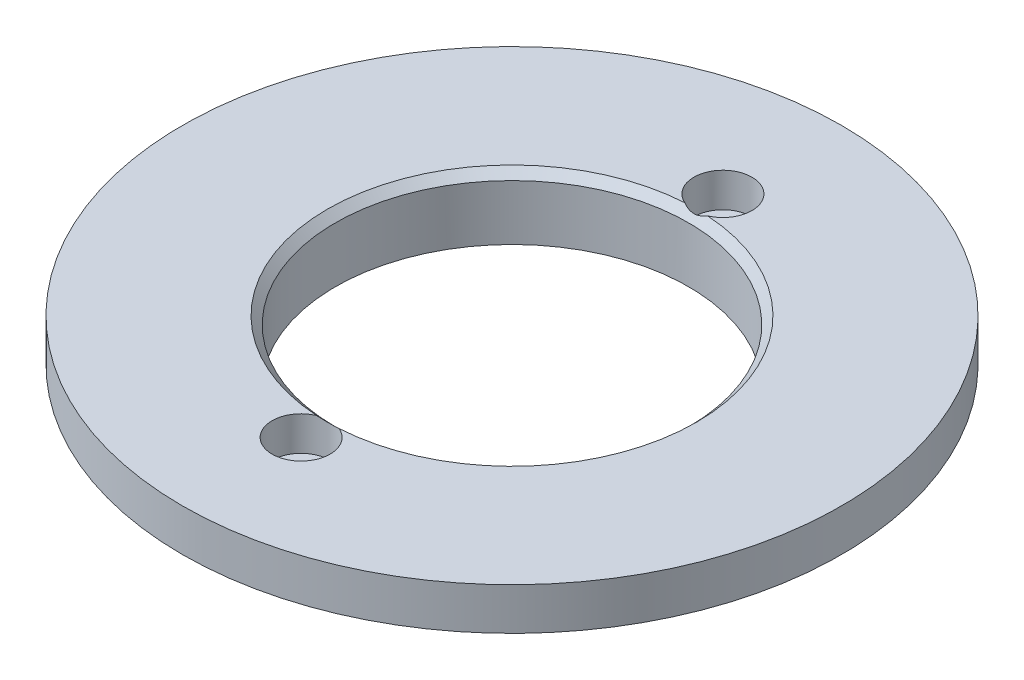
ISO-10303-21;
HEADER;
FILE_DESCRIPTION(('STEP AP214'),'2;1');
FILE_NAME('part.step','',(''),(''),'','','');
FILE_SCHEMA(('AUTOMOTIVE_DESIGN { 1 0 10303 214 1 1 1 1 }'));
ENDSEC;
DATA;
#1=APPLICATION_CONTEXT('core data for automotive mechanical design processes');
#2=APPLICATION_PROTOCOL_DEFINITION('international standard','automotive_design',2000,#1);
#3=PRODUCT_CONTEXT('',#1,'mechanical');
#4=PRODUCT('Part','Part','',(#3));
#5=PRODUCT_RELATED_PRODUCT_CATEGORY('part','',(#4));
#6=PRODUCT_DEFINITION_FORMATION('','',#4);
#7=PRODUCT_DEFINITION_CONTEXT('part definition',#1,'design');
#8=PRODUCT_DEFINITION('design','',#6,#7);
#9=PRODUCT_DEFINITION_SHAPE('','',#8);
#10=(LENGTH_UNIT() NAMED_UNIT(*) SI_UNIT(.MILLI.,.METRE.));
#11=(NAMED_UNIT(*) PLANE_ANGLE_UNIT() SI_UNIT($,.RADIAN.));
#12=(NAMED_UNIT(*) SI_UNIT($,.STERADIAN.) SOLID_ANGLE_UNIT());
#13=UNCERTAINTY_MEASURE_WITH_UNIT(LENGTH_MEASURE(1.E-05),#10,'distance_accuracy_value','');
#14=(GEOMETRIC_REPRESENTATION_CONTEXT(3) GLOBAL_UNCERTAINTY_ASSIGNED_CONTEXT((#13)) GLOBAL_UNIT_ASSIGNED_CONTEXT((#10,
#11,#12)) REPRESENTATION_CONTEXT('',''));
#15=CARTESIAN_POINT('',(0.,0.,0.));
#16=DIRECTION('',(0.,0.,1.));
#17=DIRECTION('',(1.,0.,0.));
#18=AXIS2_PLACEMENT_3D('',#15,#16,#17);
#19=CARTESIAN_POINT('',(0.,93.,65.));
#20=DIRECTION('',(0.,-1.,0.));
#21=DIRECTION('',(0.,0.,-1.));
#22=AXIS2_PLACEMENT_3D('',#19,#20,#21);
#23=CYLINDRICAL_SURFACE('',#22,45.);
#24=CARTESIAN_POINT('',(0.,89.,65.));
#25=DIRECTION('',(0.,-1.,0.));
#26=DIRECTION('',(0.,0.,-1.));
#27=AXIS2_PLACEMENT_3D('',#24,#25,#26);
#28=CIRCLE('',#27,45.);
#29=CARTESIAN_POINT('',(0.,89.,20.));
#30=VERTEX_POINT('',#29);
#31=EDGE_CURVE('E153',#30,#30,#28,.T.);
#32=ORIENTED_EDGE('',*,*,#31,.F.);
#33=EDGE_LOOP('',(#32));
#34=FACE_BOUND('',#33,.T.);
#35=CARTESIAN_POINT('',(0.,93.,65.));
#36=DIRECTION('',(0.,-1.,0.));
#37=DIRECTION('',(0.,0.,-1.));
#38=AXIS2_PLACEMENT_3D('',#35,#36,#37);
#39=CIRCLE('',#38,45.);
#40=CARTESIAN_POINT('',(0.,93.,20.));
#41=VERTEX_POINT('',#40);
#42=EDGE_CURVE('E20',#41,#41,#39,.F.);
#43=ORIENTED_EDGE('',*,*,#42,.F.);
#44=EDGE_LOOP('',(#43));
#45=FACE_BOUND('',#44,.T.);
#46=ADVANCED_FACE('F16',(#34,#45),#23,.T.);
#47=CARTESIAN_POINT('',(0.,89.,25.));
#48=DIRECTION('',(0.,1.,0.));
#49=DIRECTION('',(0.,0.,1.));
#50=AXIS2_PLACEMENT_3D('',#47,#48,#49);
#51=CYLINDRICAL_SURFACE('',#50,3.5);
#52=CARTESIAN_POINT('',(0.,89.,25.));
#53=DIRECTION('',(0.,1.,0.));
#54=DIRECTION('',(0.,0.,1.));
#55=AXIS2_PLACEMENT_3D('',#52,#53,#54);
#56=CIRCLE('',#55,3.5);
#57=CARTESIAN_POINT('',(0.,89.,28.5));
#58=VERTEX_POINT('',#57);
#59=EDGE_CURVE('E147',#58,#58,#56,.T.);
#60=ORIENTED_EDGE('',*,*,#59,.F.);
#61=EDGE_LOOP('',(#60));
#62=FACE_BOUND('',#61,.T.);
#63=CARTESIAN_POINT('',(0.,94.5,25.));
#64=DIRECTION('',(0.,1.,0.));
#65=DIRECTION('',(0.,0.,1.));
#66=AXIS2_PLACEMENT_3D('',#63,#64,#65);
#67=CIRCLE('',#66,3.5);
#68=CARTESIAN_POINT('',(0.,94.5,28.5));
#69=VERTEX_POINT('',#68);
#70=EDGE_CURVE('E155',#69,#69,#67,.T.);
#71=ORIENTED_EDGE('',*,*,#70,.T.);
#72=EDGE_LOOP('',(#71));
#73=FACE_BOUND('',#72,.T.);
#74=ADVANCED_FACE('F85',(#62,#73),#51,.F.);
#75=CARTESIAN_POINT('',(0.,89.,105.));
#76=DIRECTION('',(0.,1.,0.));
#77=DIRECTION('',(0.,0.,1.));
#78=AXIS2_PLACEMENT_3D('',#75,#76,#77);
#79=CYLINDRICAL_SURFACE('',#78,3.5);
#80=CARTESIAN_POINT('',(0.,89.,105.));
#81=DIRECTION('',(0.,1.,0.));
#82=DIRECTION('',(0.,0.,1.));
#83=AXIS2_PLACEMENT_3D('',#80,#81,#82);
#84=CIRCLE('',#83,3.5);
#85=CARTESIAN_POINT('',(0.,89.,108.5));
#86=VERTEX_POINT('',#85);
#87=EDGE_CURVE('E150',#86,#86,#84,.T.);
#88=ORIENTED_EDGE('',*,*,#87,.F.);
#89=EDGE_LOOP('',(#88));
#90=FACE_BOUND('',#89,.T.);
#91=CARTESIAN_POINT('',(0.,94.5,105.));
#92=DIRECTION('',(0.,1.,0.));
#93=DIRECTION('',(0.,0.,1.));
#94=AXIS2_PLACEMENT_3D('',#91,#92,#93);
#95=CIRCLE('',#94,3.5);
#96=CARTESIAN_POINT('',(0.,94.5,108.5));
#97=VERTEX_POINT('',#96);
#98=EDGE_CURVE('E144',#97,#97,#95,.T.);
#99=ORIENTED_EDGE('',*,*,#98,.T.);
#100=EDGE_LOOP('',(#99));
#101=FACE_BOUND('',#100,.T.);
#102=ADVANCED_FACE('F81',(#90,#101),#79,.F.);
#103=CARTESIAN_POINT('',(-63.25,93.,1.75));
#104=DIRECTION('',(0.,-1.,0.));
#105=DIRECTION('',(1.,0.,0.));
#106=AXIS2_PLACEMENT_3D('',#103,#104,#105);
#107=PLANE('',#106);
#108=ORIENTED_EDGE('',*,*,#42,.T.);
#109=EDGE_LOOP('',(#108));
#110=FACE_BOUND('',#109,.T.);
#111=CARTESIAN_POINT('',(0.,93.,65.));
#112=DIRECTION('',(0.,1.,0.));
#113=DIRECTION('',(0.,0.,1.));
#114=AXIS2_PLACEMENT_3D('',#111,#112,#113);
#115=CIRCLE('',#114,62.5);
#116=CARTESIAN_POINT('',(0.,93.,127.5));
#117=VERTEX_POINT('',#116);
#118=EDGE_CURVE('E141',#117,#117,#115,.F.);
#119=ORIENTED_EDGE('',*,*,#118,.T.);
#120=EDGE_LOOP('',(#119));
#121=FACE_BOUND('',#120,.T.);
#122=ADVANCED_FACE('F84',(#110,#121),#107,.T.);
#123=CARTESIAN_POINT('',(5.566,94.5,30.566));
#124=DIRECTION('',(0.,-1.,0.));
#125=DIRECTION('',(-1.,0.,0.));
#126=AXIS2_PLACEMENT_3D('',#123,#124,#125);
#127=PLANE('',#126);
#128=ORIENTED_EDGE('',*,*,#70,.F.);
#129=EDGE_LOOP('',(#128));
#130=FACE_BOUND('',#129,.T.);
#131=CARTESIAN_POINT('',(0.,94.5,25.));
#132=DIRECTION('',(0.,1.,0.));
#133=DIRECTION('',(0.,0.,1.));
#134=AXIS2_PLACEMENT_3D('',#131,#132,#133);
#135=CIRCLE('',#134,5.5);
#136=CARTESIAN_POINT('',(0.,94.5,30.5));
#137=VERTEX_POINT('',#136);
#138=EDGE_CURVE('E136',#137,#137,#135,.F.);
#139=ORIENTED_EDGE('',*,*,#138,.F.);
#140=EDGE_LOOP('',(#139));
#141=FACE_BOUND('',#140,.T.);
#142=ADVANCED_FACE('F95',(#130,#141),#127,.F.);
#143=CARTESIAN_POINT('',(45.54,89.,110.54));
#144=DIRECTION('',(0.,-1.,0.));
#145=DIRECTION('',(-1.,0.,0.));
#146=AXIS2_PLACEMENT_3D('',#143,#144,#145);
#147=PLANE('',#146);
#148=CARTESIAN_POINT('',(0.,89.,65.));
#149=DIRECTION('',(0.,1.,0.));
#150=DIRECTION('',(0.,0.,1.));
#151=AXIS2_PLACEMENT_3D('',#148,#149,#150);
#152=CIRCLE('',#151,33.5);
#153=CARTESIAN_POINT('',(0.,89.,98.5));
#154=VERTEX_POINT('',#153);
#155=EDGE_CURVE('E131',#154,#154,#152,.F.);
#156=ORIENTED_EDGE('',*,*,#155,.F.);
#157=EDGE_LOOP('',(#156));
#158=FACE_BOUND('',#157,.T.);
#159=ORIENTED_EDGE('',*,*,#59,.T.);
#160=EDGE_LOOP('',(#159));
#161=FACE_BOUND('',#160,.T.);
#162=ORIENTED_EDGE('',*,*,#87,.T.);
#163=EDGE_LOOP('',(#162));
#164=FACE_BOUND('',#163,.T.);
#165=ORIENTED_EDGE('',*,*,#31,.T.);
#166=EDGE_LOOP('',(#165));
#167=FACE_BOUND('',#166,.T.);
#168=ADVANCED_FACE('F99',(#158,#161,#164,#167),#147,.T.);
#169=CARTESIAN_POINT('',(5.566,94.5,110.566));
#170=DIRECTION('',(0.,-1.,0.));
#171=DIRECTION('',(-1.,0.,0.));
#172=AXIS2_PLACEMENT_3D('',#169,#170,#171);
#173=PLANE('',#172);
#174=ORIENTED_EDGE('',*,*,#98,.F.);
#175=EDGE_LOOP('',(#174));
#176=FACE_BOUND('',#175,.T.);
#177=CARTESIAN_POINT('',(0.,94.5,105.));
#178=DIRECTION('',(0.,1.,0.));
#179=DIRECTION('',(0.,0.,1.));
#180=AXIS2_PLACEMENT_3D('',#177,#178,#179);
#181=CIRCLE('',#180,5.5);
#182=CARTESIAN_POINT('',(0.,94.5,110.5));
#183=VERTEX_POINT('',#182);
#184=EDGE_CURVE('E129',#183,#183,#181,.F.);
#185=ORIENTED_EDGE('',*,*,#184,.F.);
#186=EDGE_LOOP('',(#185));
#187=FACE_BOUND('',#186,.T.);
#188=ADVANCED_FACE('F79',(#176,#187),#173,.F.);
#189=CARTESIAN_POINT('',(0.,93.,65.));
#190=DIRECTION('',(0.,1.,0.));
#191=DIRECTION('',(0.,0.,1.));
#192=AXIS2_PLACEMENT_3D('',#189,#190,#191);
#193=CYLINDRICAL_SURFACE('',#192,62.5);
#194=CARTESIAN_POINT('',(0.,101.,65.));
#195=DIRECTION('',(0.,1.,0.));
#196=DIRECTION('',(0.,0.,1.));
#197=AXIS2_PLACEMENT_3D('',#194,#195,#196);
#198=CIRCLE('',#197,62.5);
#199=CARTESIAN_POINT('',(0.,101.,127.5));
#200=VERTEX_POINT('',#199);
#201=EDGE_CURVE('E130',#200,#200,#198,.T.);
#202=ORIENTED_EDGE('',*,*,#201,.F.);
#203=EDGE_LOOP('',(#202));
#204=FACE_BOUND('',#203,.T.);
#205=ORIENTED_EDGE('',*,*,#118,.F.);
#206=EDGE_LOOP('',(#205));
#207=FACE_BOUND('',#206,.T.);
#208=ADVANCED_FACE('F76',(#204,#207),#193,.T.);
#209=CARTESIAN_POINT('',(0.,94.5,25.));
#210=DIRECTION('',(0.,1.,0.));
#211=DIRECTION('',(0.,0.,1.));
#212=AXIS2_PLACEMENT_3D('',#209,#210,#211);
#213=CYLINDRICAL_SURFACE('',#212,5.5);
#214=CARTESIAN_POINT('',(0.,101.,25.));
#215=DIRECTION('',(0.,1.,0.));
#216=DIRECTION('',(0.,0.,1.));
#217=AXIS2_PLACEMENT_3D('',#214,#215,#216);
#218=CIRCLE('',#217,5.5);
#219=CARTESIAN_POINT('',(-2.14229861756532,101.00000000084,30.0656249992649));
#220=VERTEX_POINT('',#219);
#221=CARTESIAN_POINT('',(2.14229861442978,101.,30.065625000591));
#222=VERTEX_POINT('',#221);
#223=EDGE_CURVE('E50',#220,#222,#218,.F.);
#224=ORIENTED_EDGE('',*,*,#223,.F.);
#225=CARTESIAN_POINT('',(2.1422986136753,100.99999999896,30.06562500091));
#226=CARTESIAN_POINT('',(2.0503284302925,100.955540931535,30.1045268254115));
#227=CARTESIAN_POINT('',(1.95630588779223,100.913395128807,30.1413300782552));
#228=CARTESIAN_POINT('',(1.76436297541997,100.834266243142,30.2103182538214));
#229=CARTESIAN_POINT('',(1.66643904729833,100.797288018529,30.2424988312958));
#230=CARTESIAN_POINT('',(1.46663689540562,100.728966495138,30.3018757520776));
#231=CARTESIAN_POINT('',(1.36474324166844,100.697648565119,30.3290496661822));
#232=CARTESIAN_POINT('',(1.15791147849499,100.641425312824,30.3777805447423));
#233=CARTESIAN_POINT('',(1.05297426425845,100.616518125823,30.3993391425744));
#234=CARTESIAN_POINT('',(0.840018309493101,100.573489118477,30.4365539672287));
#235=CARTESIAN_POINT('',(0.731985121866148,100.555407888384,30.4521748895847));
#236=CARTESIAN_POINT('',(0.514210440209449,100.526652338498,30.4770060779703));
#237=CARTESIAN_POINT('',(0.404469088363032,100.515977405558,30.4862168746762));
#238=CARTESIAN_POINT('',(0.184461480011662,100.502312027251,30.4980063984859));
#239=CARTESIAN_POINT('',(0.0741975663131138,100.499300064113,30.5006036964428));
#240=CARTESIAN_POINT('',(-0.146218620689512,100.500973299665,30.4991605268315));
#241=CARTESIAN_POINT('',(-0.25637090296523,100.505657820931,30.4951206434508));
#242=CARTESIAN_POINT('',(-0.467911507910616,100.522009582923,30.4810114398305));
#243=CARTESIAN_POINT('',(-0.569369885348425,100.533160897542,30.4713875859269));
#244=CARTESIAN_POINT('',(-0.770729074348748,100.561771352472,30.4466770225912));
#245=CARTESIAN_POINT('',(-0.870629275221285,100.579232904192,30.4315882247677));
#246=CARTESIAN_POINT('',(-1.16732193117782,100.640675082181,30.3784416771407));
#247=CARTESIAN_POINT('',(-1.3609706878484,100.693702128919,30.3325132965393));
#248=CARTESIAN_POINT('',(-1.65147014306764,100.791753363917,30.2473136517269));
#249=CARTESIAN_POINT('',(-1.75275664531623,100.829687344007,30.2143066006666));
#250=CARTESIAN_POINT('',(-1.9508179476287,100.910944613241,30.1434699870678));
#251=CARTESIAN_POINT('',(-2.0476111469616,100.954242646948,30.1056630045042));
#252=CARTESIAN_POINT('',(-2.14229861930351,101.00000000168,30.0656249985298));
#253=B_SPLINE_CURVE_WITH_KNOTS('',3,(#225,#226,#227,#228,#229,#230,#231,#232,#233,#234,#235,
#236,#237,#238,#239,#240,#241,#242,#243,#244,#245,#246,#247,#248,#249,#250,#251,#252),
.UNSPECIFIED.,.F.,.F.,(4,2,2,2,2,2,2,2,2,2,2,2,2,4),(0.,0.327922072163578,0.656150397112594,
0.985815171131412,1.31538394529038,1.64688272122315,1.97835405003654,2.30889356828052,
2.63940399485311,2.9465978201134,3.25390916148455,3.8689367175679,4.20792271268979,
4.54536935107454),.UNSPECIFIED.);
#254=EDGE_CURVE('E49',#222,#220,#253,.T.);
#255=ORIENTED_EDGE('',*,*,#254,.F.);
#256=EDGE_LOOP('',(#224,#255));
#257=FACE_BOUND('',#256,.T.);
#258=ORIENTED_EDGE('',*,*,#138,.T.);
#259=EDGE_LOOP('',(#258));
#260=FACE_BOUND('',#259,.T.);
#261=ADVANCED_FACE('F55',(#257,#260),#213,.F.);
#262=CARTESIAN_POINT('',(0.,89.,65.));
#263=DIRECTION('',(0.,1.,0.));
#264=DIRECTION('',(0.,0.,1.));
#265=AXIS2_PLACEMENT_3D('',#262,#263,#264);
#266=CYLINDRICAL_SURFACE('',#265,33.5);
#267=CARTESIAN_POINT('',(0.,99.5,65.));
#268=DIRECTION('',(0.,1.,0.));
#269=DIRECTION('',(1.,0.,0.));
#270=AXIS2_PLACEMENT_3D('',#267,#268,#269);
#271=CIRCLE('',#270,33.5);
#272=CARTESIAN_POINT('',(33.5,99.5,65.));
#273=VERTEX_POINT('',#272);
#274=EDGE_CURVE('E57',#273,#273,#271,.F.);
#275=ORIENTED_EDGE('',*,*,#274,.F.);
#276=EDGE_LOOP('',(#275));
#277=FACE_BOUND('',#276,.T.);
#278=ORIENTED_EDGE('',*,*,#155,.T.);
#279=EDGE_LOOP('',(#278));
#280=FACE_BOUND('',#279,.T.);
#281=ADVANCED_FACE('F75',(#277,#280),#266,.F.);
#282=CARTESIAN_POINT('',(0.,94.5,105.));
#283=DIRECTION('',(0.,1.,0.));
#284=DIRECTION('',(0.,0.,1.));
#285=AXIS2_PLACEMENT_3D('',#282,#283,#284);
#286=CYLINDRICAL_SURFACE('',#285,5.5);
#287=ORIENTED_EDGE('',*,*,#184,.T.);
#288=EDGE_LOOP('',(#287));
#289=FACE_BOUND('',#288,.T.);
#290=CARTESIAN_POINT('',(-2.14229862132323,101.000000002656,99.9343750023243));
#291=CARTESIAN_POINT('',(-2.0503284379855,100.955540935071,99.8954731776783));
#292=CARTESIAN_POINT('',(-1.95630589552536,100.913395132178,99.858669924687));
#293=CARTESIAN_POINT('',(-1.76436298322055,100.834266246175,99.7896817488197));
#294=CARTESIAN_POINT('',(-1.66643905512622,100.797288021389,99.7575011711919));
#295=CARTESIAN_POINT('',(-1.46663690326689,100.728966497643,99.6981242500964));
#296=CARTESIAN_POINT('',(-1.36474324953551,100.697648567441,99.6709503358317));
#297=CARTESIAN_POINT('',(-1.1579114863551,100.641425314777,99.6222194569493));
#298=CARTESIAN_POINT('',(-1.05297427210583,100.61651812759,99.600660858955));
#299=CARTESIAN_POINT('',(-0.840018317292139,100.57348911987,99.5634460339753));
#300=CARTESIAN_POINT('',(-0.731985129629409,100.55540788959,99.5478251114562));
#301=CARTESIAN_POINT('',(-0.51421044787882,100.526652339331,99.5229939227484));
#302=CARTESIAN_POINT('',(-0.404469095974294,100.515977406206,99.5137831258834));
#303=CARTESIAN_POINT('',(-0.184461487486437,100.50231202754,99.5019936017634));
#304=CARTESIAN_POINT('',(-0.0741975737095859,100.499300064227,99.4993963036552));
#305=CARTESIAN_POINT('',(0.146218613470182,100.50097329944,99.5008394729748));
#306=CARTESIAN_POINT('',(0.256370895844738,100.505657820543,99.504879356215));
#307=CARTESIAN_POINT('',(0.467911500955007,100.522009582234,99.5189885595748));
#308=CARTESIAN_POINT('',(0.569369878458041,100.53316089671,99.528612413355));
#309=CARTESIAN_POINT('',(0.770729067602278,100.561771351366,99.5533229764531));
#310=CARTESIAN_POINT('',(0.870629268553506,100.579232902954,99.5684117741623));
#311=CARTESIAN_POINT('',(1.16732192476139,100.640675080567,99.621558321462));
#312=CARTESIAN_POINT('',(1.36097068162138,100.693702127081,99.6674867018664));
#313=CARTESIAN_POINT('',(1.65147013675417,100.791753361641,99.7526863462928));
#314=CARTESIAN_POINT('',(1.75275663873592,100.829687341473,99.7856933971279));
#315=CARTESIAN_POINT('',(1.95081794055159,100.910944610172,99.8565300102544));
#316=CARTESIAN_POINT('',(2.04761113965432,100.954242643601,99.8943369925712));
#317=CARTESIAN_POINT('',(2.14229861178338,100.999999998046,99.9343749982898));
#318=B_SPLINE_CURVE_WITH_KNOTS('',3,(#290,#291,#292,#293,#294,#295,#296,#297,#298,#299,#300,
#301,#302,#303,#304,#305,#306,#307,#308,#309,#310,#311,#312,#313,#314,#315,#316,#317),
.UNSPECIFIED.,.F.,.F.,(4,2,2,2,2,2,2,2,2,2,2,2,2,4),(0.,0.327922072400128,0.656150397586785,
0.98581517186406,1.31538394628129,1.64688272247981,1.97835405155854,2.30889357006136,
2.6394039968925,2.94659782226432,3.25390916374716,3.86893672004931,4.2079227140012,
4.54536935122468),.UNSPECIFIED.);
#319=CARTESIAN_POINT('',(-2.1422986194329,101.,99.9343750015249));
#320=VERTEX_POINT('',#319);
#321=CARTESIAN_POINT('',(2.14229861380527,100.999999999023,99.9343749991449));
#322=VERTEX_POINT('',#321);
#323=EDGE_CURVE('E25',#320,#322,#318,.T.);
#324=ORIENTED_EDGE('',*,*,#323,.F.);
#325=CARTESIAN_POINT('',(0.,101.,105.));
#326=DIRECTION('',(0.,1.,0.));
#327=DIRECTION('',(0.,0.,1.));
#328=AXIS2_PLACEMENT_3D('',#325,#326,#327);
#329=CIRCLE('',#328,5.5);
#330=EDGE_CURVE('E32',#322,#320,#329,.F.);
#331=ORIENTED_EDGE('',*,*,#330,.F.);
#332=EDGE_LOOP('',(#324,#331));
#333=FACE_BOUND('',#332,.T.);
#334=ADVANCED_FACE('F114',(#289,#333),#286,.F.);
#335=CARTESIAN_POINT('',(63.25,101.,1.75));
#336=DIRECTION('',(0.,1.,0.));
#337=DIRECTION('',(-1.,0.,0.));
#338=AXIS2_PLACEMENT_3D('',#335,#336,#337);
#339=PLANE('',#338);
#340=CARTESIAN_POINT('',(0.,101.,65.));
#341=DIRECTION('',(0.,1.,0.));
#342=DIRECTION('',(0.,0.,1.));
#343=AXIS2_PLACEMENT_3D('',#340,#341,#342);
#344=CIRCLE('',#343,35.);
#345=EDGE_CURVE('E52',#220,#320,#344,.T.);
#346=ORIENTED_EDGE('',*,*,#345,.F.);
#347=ORIENTED_EDGE('',*,*,#223,.T.);
#348=CARTESIAN_POINT('',(0.,101.,65.));
#349=DIRECTION('',(0.,1.,0.));
#350=DIRECTION('',(0.,0.,1.));
#351=AXIS2_PLACEMENT_3D('',#348,#349,#350);
#352=CIRCLE('',#351,35.);
#353=EDGE_CURVE('E11',#322,#222,#352,.T.);
#354=ORIENTED_EDGE('',*,*,#353,.F.);
#355=ORIENTED_EDGE('',*,*,#330,.T.);
#356=EDGE_LOOP('',(#346,#347,#354,#355));
#357=FACE_BOUND('',#356,.T.);
#358=ORIENTED_EDGE('',*,*,#201,.T.);
#359=EDGE_LOOP('',(#358));
#360=FACE_BOUND('',#359,.T.);
#361=ADVANCED_FACE('F18',(#357,#360),#339,.T.);
#362=CARTESIAN_POINT('',(0.,99.5,65.));
#363=DIRECTION('',(0.,1.,0.));
#364=DIRECTION('',(0.,0.,1.));
#365=AXIS2_PLACEMENT_3D('',#362,#363,#364);
#366=CONICAL_SURFACE('',#365,33.5,0.785398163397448);
#367=ORIENTED_EDGE('',*,*,#254,.T.);
#368=ORIENTED_EDGE('',*,*,#345,.T.);
#369=ORIENTED_EDGE('',*,*,#323,.T.);
#370=ORIENTED_EDGE('',*,*,#353,.T.);
#371=EDGE_LOOP('',(#367,#368,#369,#370));
#372=FACE_BOUND('',#371,.T.);
#373=ORIENTED_EDGE('',*,*,#274,.T.);
#374=EDGE_LOOP('',(#373));
#375=FACE_BOUND('',#374,.T.);
#376=ADVANCED_FACE('F46',(#372,#375),#366,.F.);
#377=CLOSED_SHELL('',(#46,#74,#102,#122,#142,#168,#188,#208,#261,#281,#334,#361,#376));
#378=MANIFOLD_SOLID_BREP('B1',#377);
#379=ADVANCED_BREP_SHAPE_REPRESENTATION('',(#18,#378),#14);
#380=SHAPE_DEFINITION_REPRESENTATION(#9,#379);
ENDSEC;
END-ISO-10303-21;
